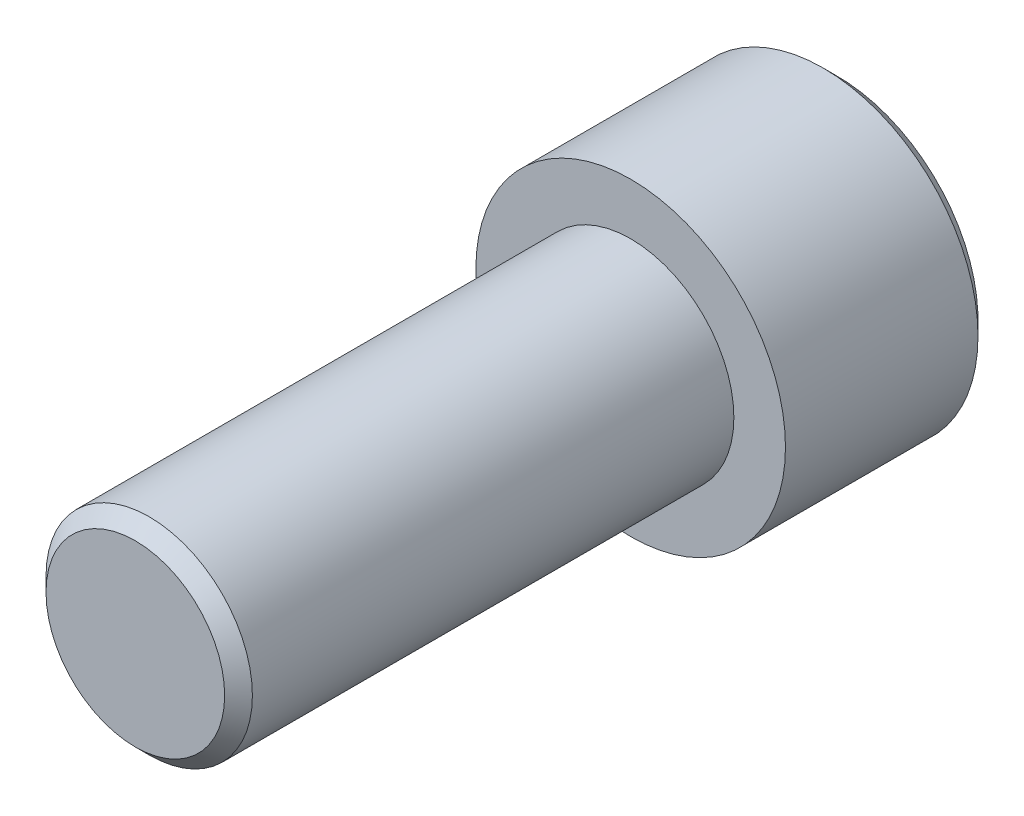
ISO-10303-21;
HEADER;
FILE_DESCRIPTION(('STEP AP214'),'2;1');
FILE_NAME('part.step','',(''),(''),'','','');
FILE_SCHEMA(('AUTOMOTIVE_DESIGN { 1 0 10303 214 1 1 1 1 }'));
ENDSEC;
DATA;
#1=APPLICATION_CONTEXT('core data for automotive mechanical design processes');
#2=APPLICATION_PROTOCOL_DEFINITION('international standard','automotive_design',2000,#1);
#3=PRODUCT_CONTEXT('',#1,'mechanical');
#4=PRODUCT('Part','Part','',(#3));
#5=PRODUCT_RELATED_PRODUCT_CATEGORY('part','',(#4));
#6=PRODUCT_DEFINITION_FORMATION('','',#4);
#7=PRODUCT_DEFINITION_CONTEXT('part definition',#1,'design');
#8=PRODUCT_DEFINITION('design','',#6,#7);
#9=PRODUCT_DEFINITION_SHAPE('','',#8);
#10=(LENGTH_UNIT() NAMED_UNIT(*) SI_UNIT(.MILLI.,.METRE.));
#11=(NAMED_UNIT(*) PLANE_ANGLE_UNIT() SI_UNIT($,.RADIAN.));
#12=(NAMED_UNIT(*) SI_UNIT($,.STERADIAN.) SOLID_ANGLE_UNIT());
#13=UNCERTAINTY_MEASURE_WITH_UNIT(LENGTH_MEASURE(1.E-05),#10,'distance_accuracy_value','');
#14=(GEOMETRIC_REPRESENTATION_CONTEXT(3) GLOBAL_UNCERTAINTY_ASSIGNED_CONTEXT((#13)) GLOBAL_UNIT_ASSIGNED_CONTEXT((#10,
#11,#12)) REPRESENTATION_CONTEXT('',''));
#15=CARTESIAN_POINT('',(0.,0.,0.));
#16=DIRECTION('',(0.,0.,1.));
#17=DIRECTION('',(1.,0.,0.));
#18=AXIS2_PLACEMENT_3D('',#15,#16,#17);
#19=CARTESIAN_POINT('',(0.,0.,19.05));
#20=DIRECTION('',(0.,0.,1.));
#21=DIRECTION('',(1.,0.,0.));
#22=AXIS2_PLACEMENT_3D('',#19,#20,#21);
#23=PLANE('',#22);
#24=CARTESIAN_POINT('',(0.,0.,19.05));
#25=DIRECTION('',(0.,0.,1.));
#26=DIRECTION('',(1.,0.,0.));
#27=AXIS2_PLACEMENT_3D('',#24,#25,#26);
#28=CIRCLE('',#27,3.43535);
#29=CARTESIAN_POINT('',(3.43535,0.,19.05));
#30=VERTEX_POINT('',#29);
#31=EDGE_CURVE('E40',#30,#30,#28,.T.);
#32=ORIENTED_EDGE('',*,*,#31,.T.);
#33=EDGE_LOOP('',(#32));
#34=FACE_BOUND('',#33,.T.);
#35=ADVANCED_FACE('F32',(#34),#23,.T.);
#36=CARTESIAN_POINT('',(0.,0.,19.05));
#37=DIRECTION('',(0.,0.,1.));
#38=DIRECTION('',(1.,0.,0.));
#39=AXIS2_PLACEMENT_3D('',#36,#37,#38);
#40=CYLINDRICAL_SURFACE('',#39,3.96875);
#41=CARTESIAN_POINT('',(0.,0.,18.5166));
#42=DIRECTION('',(0.,0.,1.));
#43=DIRECTION('',(1.,0.,0.));
#44=AXIS2_PLACEMENT_3D('',#41,#42,#43);
#45=CIRCLE('',#44,3.96875);
#46=CARTESIAN_POINT('',(3.96875,0.,18.5166));
#47=VERTEX_POINT('',#46);
#48=EDGE_CURVE('E11',#47,#47,#45,.F.);
#49=ORIENTED_EDGE('',*,*,#48,.T.);
#50=EDGE_LOOP('',(#49));
#51=FACE_BOUND('',#50,.T.);
#52=CARTESIAN_POINT('',(0.,0.,0.));
#53=DIRECTION('',(0.,0.,1.));
#54=DIRECTION('',(1.,0.,0.));
#55=AXIS2_PLACEMENT_3D('',#52,#53,#54);
#56=CIRCLE('',#55,3.96875);
#57=CARTESIAN_POINT('',(3.96875,0.,0.));
#58=VERTEX_POINT('',#57);
#59=EDGE_CURVE('E142',#58,#58,#56,.T.);
#60=ORIENTED_EDGE('',*,*,#59,.T.);
#61=EDGE_LOOP('',(#60));
#62=FACE_BOUND('',#61,.T.);
#63=ADVANCED_FACE('F163',(#51,#62),#40,.T.);
#64=CARTESIAN_POINT('',(3.96875,0.,0.));
#65=DIRECTION('',(0.,0.,1.));
#66=DIRECTION('',(1.,0.,0.));
#67=AXIS2_PLACEMENT_3D('',#64,#65,#66);
#68=PLANE('',#67);
#69=CARTESIAN_POINT('',(0.,0.,0.));
#70=DIRECTION('',(0.,0.,1.));
#71=DIRECTION('',(1.,0.,0.));
#72=AXIS2_PLACEMENT_3D('',#69,#70,#71);
#73=CIRCLE('',#72,5.953125);
#74=CARTESIAN_POINT('',(5.953125,0.,0.));
#75=VERTEX_POINT('',#74);
#76=EDGE_CURVE('E134',#75,#75,#73,.T.);
#77=ORIENTED_EDGE('',*,*,#76,.T.);
#78=EDGE_LOOP('',(#77));
#79=FACE_BOUND('',#78,.T.);
#80=ORIENTED_EDGE('',*,*,#59,.F.);
#81=EDGE_LOOP('',(#80));
#82=FACE_BOUND('',#81,.T.);
#83=ADVANCED_FACE('F168',(#79,#82),#68,.T.);
#84=CARTESIAN_POINT('',(0.,0.,19.05));
#85=DIRECTION('',(0.,0.,1.));
#86=DIRECTION('',(1.,0.,0.));
#87=AXIS2_PLACEMENT_3D('',#84,#85,#86);
#88=CYLINDRICAL_SURFACE('',#87,5.953125);
#89=CARTESIAN_POINT('',(0.,0.,-7.4041));
#90=DIRECTION('',(0.,0.,-1.));
#91=DIRECTION('',(-1.,0.,0.));
#92=AXIS2_PLACEMENT_3D('',#89,#90,#91);
#93=CIRCLE('',#92,5.953125);
#94=CARTESIAN_POINT('',(-5.953125,0.,-7.4041));
#95=VERTEX_POINT('',#94);
#96=EDGE_CURVE('E145',#95,#95,#93,.F.);
#97=ORIENTED_EDGE('',*,*,#96,.T.);
#98=EDGE_LOOP('',(#97));
#99=FACE_BOUND('',#98,.T.);
#100=ORIENTED_EDGE('',*,*,#76,.F.);
#101=EDGE_LOOP('',(#100));
#102=FACE_BOUND('',#101,.T.);
#103=ADVANCED_FACE('F174',(#99,#102),#88,.T.);
#104=CARTESIAN_POINT('',(5.953125,0.,-7.9375));
#105=DIRECTION('',(0.,0.,-1.));
#106=DIRECTION('',(-1.,0.,0.));
#107=AXIS2_PLACEMENT_3D('',#104,#105,#106);
#108=PLANE('',#107);
#109=CARTESIAN_POINT('',(0.,0.,-7.9375));
#110=DIRECTION('',(0.,0.,-1.));
#111=DIRECTION('',(-1.,0.,0.));
#112=AXIS2_PLACEMENT_3D('',#109,#110,#111);
#113=CIRCLE('',#112,5.419725);
#114=CARTESIAN_POINT('',(-5.419725,0.,-7.9375));
#115=VERTEX_POINT('',#114);
#116=EDGE_CURVE('E148',#115,#115,#113,.T.);
#117=ORIENTED_EDGE('',*,*,#116,.T.);
#118=EDGE_LOOP('',(#117));
#119=FACE_BOUND('',#118,.T.);
#120=DIRECTION('',(0.00412520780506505,-0.999991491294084,0.));
#121=VECTOR('',#120,1.);
#122=CARTESIAN_POINT('',(3.16741111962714,1.84616904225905,-7.9375));
#123=LINE('',#122,#121);
#124=CARTESIAN_POINT('',(3.16741111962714,1.84616904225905,-7.9375));
#125=VERTEX_POINT('',#124);
#126=CARTESIAN_POINT('',(3.1825348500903,-1.81997397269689,-7.9375));
#127=VERTEX_POINT('',#126);
#128=EDGE_CURVE('E47',#125,#127,#123,.T.);
#129=ORIENTED_EDGE('',*,*,#128,.F.);
#130=DIRECTION('',(0.868080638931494,-0.496423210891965,0.));
#131=VECTOR('',#130,1.);
#132=CARTESIAN_POINT('',(-0.0151237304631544,3.66614301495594,-7.9375));
#133=LINE('',#132,#131);
#134=CARTESIAN_POINT('',(-0.0151237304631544,3.66614301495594,-7.9375));
#135=VERTEX_POINT('',#134);
#136=EDGE_CURVE('E130',#135,#125,#133,.T.);
#137=ORIENTED_EDGE('',*,*,#136,.F.);
#138=DIRECTION('',(0.863955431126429,0.503568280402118,0.));
#139=VECTOR('',#138,1.);
#140=CARTESIAN_POINT('',(-3.18253485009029,1.81997397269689,-7.9375));
#141=LINE('',#140,#139);
#142=CARTESIAN_POINT('',(-3.18253485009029,1.81997397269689,-7.9375));
#143=VERTEX_POINT('',#142);
#144=EDGE_CURVE('E128',#143,#135,#141,.T.);
#145=ORIENTED_EDGE('',*,*,#144,.F.);
#146=DIRECTION('',(-0.00412520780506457,0.999991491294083,0.));
#147=VECTOR('',#146,1.);
#148=CARTESIAN_POINT('',(-3.16741111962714,-1.84616904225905,-7.9375));
#149=LINE('',#148,#147);
#150=CARTESIAN_POINT('',(-3.16741111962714,-1.84616904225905,-7.9375));
#151=VERTEX_POINT('',#150);
#152=EDGE_CURVE('E95',#151,#143,#149,.T.);
#153=ORIENTED_EDGE('',*,*,#152,.F.);
#154=DIRECTION('',(-0.868080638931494,0.496423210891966,0.));
#155=VECTOR('',#154,1.);
#156=CARTESIAN_POINT('',(0.0151237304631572,-3.66614301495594,-7.9375));
#157=LINE('',#156,#155);
#158=CARTESIAN_POINT('',(0.0151237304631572,-3.66614301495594,-7.9375));
#159=VERTEX_POINT('',#158);
#160=EDGE_CURVE('E124',#159,#151,#157,.T.);
#161=ORIENTED_EDGE('',*,*,#160,.F.);
#162=DIRECTION('',(-0.863955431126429,-0.503568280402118,0.));
#163=VECTOR('',#162,1.);
#164=CARTESIAN_POINT('',(3.1825348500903,-1.81997397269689,-7.9375));
#165=LINE('',#164,#163);
#166=EDGE_CURVE('E121',#127,#159,#165,.T.);
#167=ORIENTED_EDGE('',*,*,#166,.F.);
#168=EDGE_LOOP('',(#129,#137,#145,#153,#161,#167));
#169=FACE_BOUND('',#168,.T.);
#170=ADVANCED_FACE('F178',(#119,#169),#108,.T.);
#171=CARTESIAN_POINT('',(3.16741111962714,1.84616904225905,-1.5875));
#172=DIRECTION('',(0.999991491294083,0.00412520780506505,0.));
#173=DIRECTION('',(-0.00412520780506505,0.999991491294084,0.));
#174=AXIS2_PLACEMENT_3D('',#171,#172,#173);
#175=PLANE('',#174);
#176=ORIENTED_EDGE('',*,*,#128,.T.);
#177=DIRECTION('',(0.,0.,-1.));
#178=VECTOR('',#177,1.);
#179=CARTESIAN_POINT('',(3.1825348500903,-1.81997397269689,-1.5875));
#180=LINE('',#179,#178);
#181=CARTESIAN_POINT('',(3.1825348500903,-1.81997397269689,-1.5875));
#182=VERTEX_POINT('',#181);
#183=EDGE_CURVE('E77',#182,#127,#180,.T.);
#184=ORIENTED_EDGE('',*,*,#183,.F.);
#185=DIRECTION('',(0.00412520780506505,-0.999991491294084,0.));
#186=VECTOR('',#185,1.);
#187=CARTESIAN_POINT('',(3.16741111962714,1.84616904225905,-1.5875));
#188=LINE('',#187,#186);
#189=CARTESIAN_POINT('',(3.16741111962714,1.84616904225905,-1.5875));
#190=VERTEX_POINT('',#189);
#191=EDGE_CURVE('E132',#190,#182,#188,.T.);
#192=ORIENTED_EDGE('',*,*,#191,.F.);
#193=DIRECTION('',(0.,0.,-1.));
#194=VECTOR('',#193,1.);
#195=CARTESIAN_POINT('',(3.16741111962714,1.84616904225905,-1.5875));
#196=LINE('',#195,#194);
#197=EDGE_CURVE('E55',#190,#125,#196,.T.);
#198=ORIENTED_EDGE('',*,*,#197,.T.);
#199=EDGE_LOOP('',(#176,#184,#192,#198));
#200=FACE_BOUND('',#199,.T.);
#201=ADVANCED_FACE('F182',(#200),#175,.F.);
#202=CARTESIAN_POINT('',(-0.0151237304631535,3.66614301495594,-1.5875));
#203=DIRECTION('',(0.496423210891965,0.868080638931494,0.));
#204=DIRECTION('',(-0.868080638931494,0.496423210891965,0.));
#205=AXIS2_PLACEMENT_3D('',#202,#203,#204);
#206=PLANE('',#205);
#207=ORIENTED_EDGE('',*,*,#136,.T.);
#208=ORIENTED_EDGE('',*,*,#197,.F.);
#209=DIRECTION('',(0.868080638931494,-0.496423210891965,0.));
#210=VECTOR('',#209,1.);
#211=CARTESIAN_POINT('',(-0.0151237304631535,3.66614301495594,-1.5875));
#212=LINE('',#211,#210);
#213=CARTESIAN_POINT('',(-0.0151237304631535,3.66614301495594,-1.5875));
#214=VERTEX_POINT('',#213);
#215=EDGE_CURVE('E107',#214,#190,#212,.T.);
#216=ORIENTED_EDGE('',*,*,#215,.F.);
#217=DIRECTION('',(0.,0.,-1.));
#218=VECTOR('',#217,1.);
#219=CARTESIAN_POINT('',(-0.0151237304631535,3.66614301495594,-1.5875));
#220=LINE('',#219,#218);
#221=EDGE_CURVE('E99',#214,#135,#220,.T.);
#222=ORIENTED_EDGE('',*,*,#221,.T.);
#223=EDGE_LOOP('',(#207,#208,#216,#222));
#224=FACE_BOUND('',#223,.T.);
#225=ADVANCED_FACE('F186',(#224),#206,.F.);
#226=CARTESIAN_POINT('',(-3.18253485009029,1.81997397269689,-1.5875));
#227=DIRECTION('',(-0.503568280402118,0.863955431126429,0.));
#228=DIRECTION('',(-0.863955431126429,-0.503568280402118,0.));
#229=AXIS2_PLACEMENT_3D('',#226,#227,#228);
#230=PLANE('',#229);
#231=ORIENTED_EDGE('',*,*,#144,.T.);
#232=ORIENTED_EDGE('',*,*,#221,.F.);
#233=DIRECTION('',(0.863955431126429,0.503568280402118,0.));
#234=VECTOR('',#233,1.);
#235=CARTESIAN_POINT('',(-3.18253485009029,1.81997397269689,-1.5875));
#236=LINE('',#235,#234);
#237=CARTESIAN_POINT('',(-3.18253485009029,1.81997397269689,-1.5875));
#238=VERTEX_POINT('',#237);
#239=EDGE_CURVE('E103',#238,#214,#236,.T.);
#240=ORIENTED_EDGE('',*,*,#239,.F.);
#241=DIRECTION('',(0.,0.,-1.));
#242=VECTOR('',#241,1.);
#243=CARTESIAN_POINT('',(-3.18253485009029,1.81997397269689,-1.5875));
#244=LINE('',#243,#242);
#245=EDGE_CURVE('E88',#238,#143,#244,.T.);
#246=ORIENTED_EDGE('',*,*,#245,.T.);
#247=EDGE_LOOP('',(#231,#232,#240,#246));
#248=FACE_BOUND('',#247,.T.);
#249=ADVANCED_FACE('F104',(#248),#230,.F.);
#250=CARTESIAN_POINT('',(-3.16741111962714,-1.84616904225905,-1.5875));
#251=DIRECTION('',(-0.999991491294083,-0.00412520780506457,0.));
#252=DIRECTION('',(0.00412520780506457,-0.999991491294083,0.));
#253=AXIS2_PLACEMENT_3D('',#250,#251,#252);
#254=PLANE('',#253);
#255=ORIENTED_EDGE('',*,*,#152,.T.);
#256=ORIENTED_EDGE('',*,*,#245,.F.);
#257=DIRECTION('',(-0.00412520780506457,0.999991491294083,0.));
#258=VECTOR('',#257,1.);
#259=CARTESIAN_POINT('',(-3.16741111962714,-1.84616904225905,-1.5875));
#260=LINE('',#259,#258);
#261=CARTESIAN_POINT('',(-3.16741111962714,-1.84616904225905,-1.5875));
#262=VERTEX_POINT('',#261);
#263=EDGE_CURVE('E92',#262,#238,#260,.T.);
#264=ORIENTED_EDGE('',*,*,#263,.F.);
#265=DIRECTION('',(0.,0.,-1.));
#266=VECTOR('',#265,1.);
#267=CARTESIAN_POINT('',(-3.16741111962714,-1.84616904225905,-1.5875));
#268=LINE('',#267,#266);
#269=EDGE_CURVE('E100',#262,#151,#268,.T.);
#270=ORIENTED_EDGE('',*,*,#269,.T.);
#271=EDGE_LOOP('',(#255,#256,#264,#270));
#272=FACE_BOUND('',#271,.T.);
#273=ADVANCED_FACE('F90',(#272),#254,.F.);
#274=CARTESIAN_POINT('',(0.0151237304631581,-3.66614301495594,-1.5875));
#275=DIRECTION('',(-0.496423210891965,-0.868080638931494,0.));
#276=DIRECTION('',(0.868080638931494,-0.496423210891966,0.));
#277=AXIS2_PLACEMENT_3D('',#274,#275,#276);
#278=PLANE('',#277);
#279=ORIENTED_EDGE('',*,*,#160,.T.);
#280=ORIENTED_EDGE('',*,*,#269,.F.);
#281=DIRECTION('',(-0.868080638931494,0.496423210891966,0.));
#282=VECTOR('',#281,1.);
#283=CARTESIAN_POINT('',(0.0151237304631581,-3.66614301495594,-1.5875));
#284=LINE('',#283,#282);
#285=CARTESIAN_POINT('',(0.0151237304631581,-3.66614301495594,-1.5875));
#286=VERTEX_POINT('',#285);
#287=EDGE_CURVE('E113',#286,#262,#284,.T.);
#288=ORIENTED_EDGE('',*,*,#287,.F.);
#289=DIRECTION('',(0.,0.,-1.));
#290=VECTOR('',#289,1.);
#291=CARTESIAN_POINT('',(0.0151237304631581,-3.66614301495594,-1.5875));
#292=LINE('',#291,#290);
#293=EDGE_CURVE('E137',#286,#159,#292,.T.);
#294=ORIENTED_EDGE('',*,*,#293,.T.);
#295=EDGE_LOOP('',(#279,#280,#288,#294));
#296=FACE_BOUND('',#295,.T.);
#297=ADVANCED_FACE('F190',(#296),#278,.F.);
#298=CARTESIAN_POINT('',(3.1825348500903,-1.81997397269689,-1.5875));
#299=DIRECTION('',(0.503568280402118,-0.863955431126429,0.));
#300=DIRECTION('',(0.863955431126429,0.503568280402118,0.));
#301=AXIS2_PLACEMENT_3D('',#298,#299,#300);
#302=PLANE('',#301);
#303=ORIENTED_EDGE('',*,*,#166,.T.);
#304=ORIENTED_EDGE('',*,*,#293,.F.);
#305=DIRECTION('',(-0.863955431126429,-0.503568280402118,0.));
#306=VECTOR('',#305,1.);
#307=CARTESIAN_POINT('',(3.1825348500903,-1.81997397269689,-1.5875));
#308=LINE('',#307,#306);
#309=EDGE_CURVE('E115',#182,#286,#308,.T.);
#310=ORIENTED_EDGE('',*,*,#309,.F.);
#311=ORIENTED_EDGE('',*,*,#183,.T.);
#312=EDGE_LOOP('',(#303,#304,#310,#311));
#313=FACE_BOUND('',#312,.T.);
#314=ADVANCED_FACE('F187',(#313),#302,.F.);
#315=CARTESIAN_POINT('',(3.16741111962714,1.84616904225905,-1.5875));
#316=DIRECTION('',(0.,0.,1.));
#317=DIRECTION('',(1.,0.,0.));
#318=AXIS2_PLACEMENT_3D('',#315,#316,#317);
#319=PLANE('',#318);
#320=ORIENTED_EDGE('',*,*,#191,.T.);
#321=ORIENTED_EDGE('',*,*,#309,.T.);
#322=ORIENTED_EDGE('',*,*,#287,.T.);
#323=ORIENTED_EDGE('',*,*,#263,.T.);
#324=ORIENTED_EDGE('',*,*,#239,.T.);
#325=ORIENTED_EDGE('',*,*,#215,.T.);
#326=EDGE_LOOP('',(#320,#321,#322,#323,#324,#325));
#327=FACE_BOUND('',#326,.T.);
#328=ADVANCED_FACE('F110',(#327),#319,.F.);
#329=CARTESIAN_POINT('',(0.,0.,-7.4041));
#330=DIRECTION('',(0.,0.,1.));
#331=DIRECTION('',(1.,0.,0.));
#332=AXIS2_PLACEMENT_3D('',#329,#330,#331);
#333=CONICAL_SURFACE('',#332,5.953125,0.78539816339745);
#334=ORIENTED_EDGE('',*,*,#116,.F.);
#335=EDGE_LOOP('',(#334));
#336=FACE_BOUND('',#335,.T.);
#337=ORIENTED_EDGE('',*,*,#96,.F.);
#338=EDGE_LOOP('',(#337));
#339=FACE_BOUND('',#338,.T.);
#340=ADVANCED_FACE('F155',(#336,#339),#333,.T.);
#341=CARTESIAN_POINT('',(0.,0.,19.05));
#342=DIRECTION('',(0.,0.,-1.));
#343=DIRECTION('',(-1.,0.,0.));
#344=AXIS2_PLACEMENT_3D('',#341,#342,#343);
#345=CONICAL_SURFACE('',#344,3.43535,0.785398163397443);
#346=ORIENTED_EDGE('',*,*,#48,.F.);
#347=EDGE_LOOP('',(#346));
#348=FACE_BOUND('',#347,.T.);
#349=ORIENTED_EDGE('',*,*,#31,.F.);
#350=EDGE_LOOP('',(#349));
#351=FACE_BOUND('',#350,.T.);
#352=ADVANCED_FACE('F34',(#348,#351),#345,.T.);
#353=CLOSED_SHELL('',(#35,#63,#83,#103,#170,#201,#225,#249,#273,#297,#314,#328,#340,#352));
#354=MANIFOLD_SOLID_BREP('B2',#353);
#355=ADVANCED_BREP_SHAPE_REPRESENTATION('',(#18,#354),#14);
#356=SHAPE_DEFINITION_REPRESENTATION(#9,#355);
ENDSEC;
END-ISO-10303-21;
